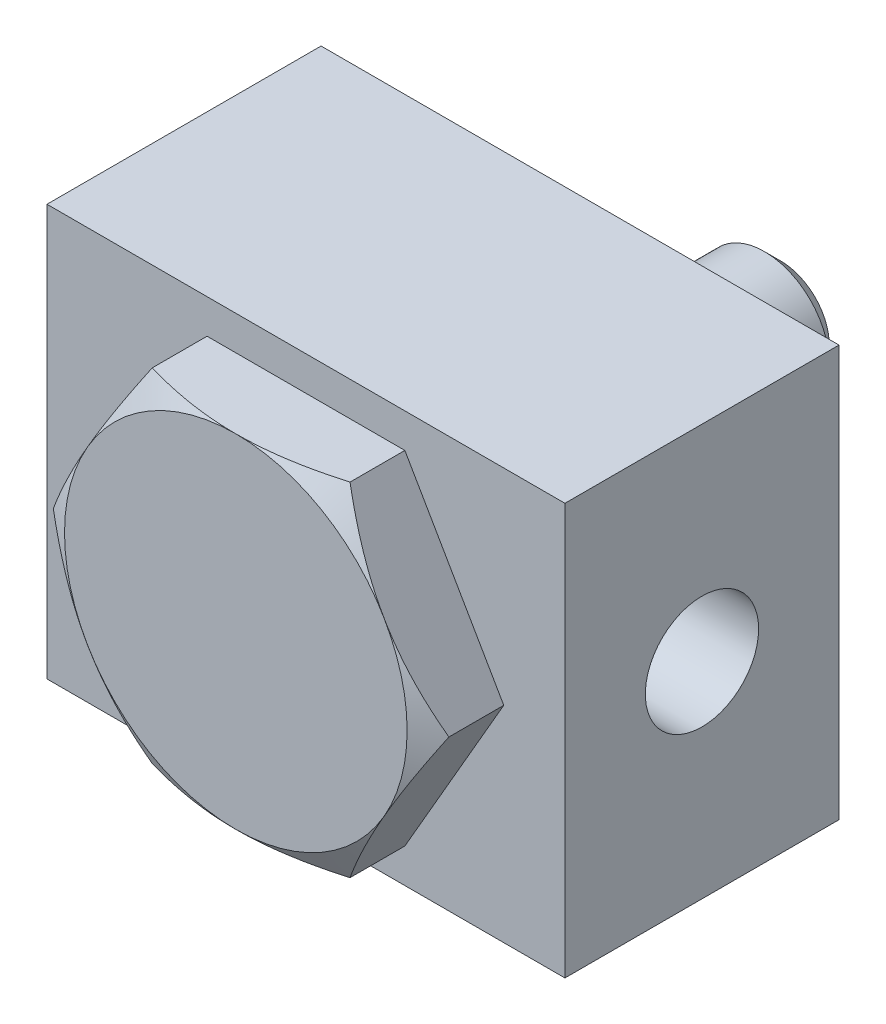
ISO-10303-21;
HEADER;
FILE_DESCRIPTION(('STEP AP214'),'2;1');
FILE_NAME('part.step','',(''),(''),'','','');
FILE_SCHEMA(('AUTOMOTIVE_DESIGN { 1 0 10303 214 1 1 1 1 }'));
ENDSEC;
DATA;
#1=APPLICATION_CONTEXT('core data for automotive mechanical design processes');
#2=APPLICATION_PROTOCOL_DEFINITION('international standard','automotive_design',2000,#1);
#3=PRODUCT_CONTEXT('',#1,'mechanical');
#4=PRODUCT('Part','Part','',(#3));
#5=PRODUCT_RELATED_PRODUCT_CATEGORY('part','',(#4));
#6=PRODUCT_DEFINITION_FORMATION('','',#4);
#7=PRODUCT_DEFINITION_CONTEXT('part definition',#1,'design');
#8=PRODUCT_DEFINITION('design','',#6,#7);
#9=PRODUCT_DEFINITION_SHAPE('','',#8);
#10=(LENGTH_UNIT() NAMED_UNIT(*) SI_UNIT(.MILLI.,.METRE.));
#11=(NAMED_UNIT(*) PLANE_ANGLE_UNIT() SI_UNIT($,.RADIAN.));
#12=(NAMED_UNIT(*) SI_UNIT($,.STERADIAN.) SOLID_ANGLE_UNIT());
#13=UNCERTAINTY_MEASURE_WITH_UNIT(LENGTH_MEASURE(1.E-05),#10,'distance_accuracy_value','');
#14=(GEOMETRIC_REPRESENTATION_CONTEXT(3) GLOBAL_UNCERTAINTY_ASSIGNED_CONTEXT((#13)) GLOBAL_UNIT_ASSIGNED_CONTEXT((#10,
#11,#12)) REPRESENTATION_CONTEXT('',''));
#15=CARTESIAN_POINT('',(0.,0.,0.));
#16=DIRECTION('',(0.,0.,1.));
#17=DIRECTION('',(1.,0.,0.));
#18=AXIS2_PLACEMENT_3D('',#15,#16,#17);
#19=CARTESIAN_POINT('',(-18.3308710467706,31.75,70.3));
#20=DIRECTION('',(0.866025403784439,-0.5,0.));
#21=DIRECTION('',(0.5,0.866025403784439,0.));
#22=AXIS2_PLACEMENT_3D('',#19,#20,#21);
#23=PLANE('',#22);
#24=CARTESIAN_POINT('',(-18.3307555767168,31.7502,62.4641377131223));
#25=CARTESIAN_POINT('',(-18.7336598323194,31.0523493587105,62.6967369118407));
#26=CARTESIAN_POINT('',(-19.13813562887,30.3517767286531,62.9187809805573));
#27=CARTESIAN_POINT('',(-19.9503306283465,28.9450137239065,63.3388249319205));
#28=CARTESIAN_POINT('',(-20.358050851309,28.238821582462,63.5368169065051));
#29=CARTESIAN_POINT('',(-21.1775313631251,26.8194397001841,63.906099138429));
#30=CARTESIAN_POINT('',(-21.5892988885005,26.1062374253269,64.0773256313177));
#31=CARTESIAN_POINT('',(-22.4156776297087,24.6749074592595,64.3893882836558));
#32=CARTESIAN_POINT('',(-22.8302885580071,23.9567802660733,64.5302274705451));
#33=CARTESIAN_POINT('',(-23.6517563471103,22.5339563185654,64.7755371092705));
#34=CARTESIAN_POINT('',(-24.0585522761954,21.8293651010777,64.8808188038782));
#35=CARTESIAN_POINT('',(-24.8740080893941,20.4169542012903,65.0573518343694));
#36=CARTESIAN_POINT('',(-25.2826680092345,19.7091344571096,65.1286025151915));
#37=CARTESIAN_POINT('',(-26.100674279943,18.2923060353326,65.2352744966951));
#38=CARTESIAN_POINT('',(-26.5100192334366,17.5832997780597,65.2707383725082));
#39=CARTESIAN_POINT('',(-27.3290869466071,16.1646328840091,65.3050740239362));
#40=CARTESIAN_POINT('',(-27.7388096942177,15.4549722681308,65.3039469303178));
#41=CARTESIAN_POINT('',(-28.5047899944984,14.1282554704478,65.2676569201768));
#42=CARTESIAN_POINT('',(-28.8611021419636,13.5111047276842,65.2369192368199));
#43=CARTESIAN_POINT('',(-29.5728766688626,12.2782750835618,65.1483534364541));
#44=CARTESIAN_POINT('',(-29.9283390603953,11.6625961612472,65.0905257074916));
#45=CARTESIAN_POINT('',(-30.6382785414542,10.4329449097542,64.9487854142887));
#46=CARTESIAN_POINT('',(-30.9927544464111,9.81897463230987,64.8648492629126));
#47=CARTESIAN_POINT('',(-31.7000213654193,8.59395239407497,64.6723649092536));
#48=CARTESIAN_POINT('',(-32.0528123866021,7.98290042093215,64.5638168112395));
#49=CARTESIAN_POINT('',(-32.7641994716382,6.75074184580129,64.3211744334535));
#50=CARTESIAN_POINT('',(-33.1227517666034,6.12971105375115,64.186569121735));
#51=CARTESIAN_POINT('',(-33.8376618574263,4.89145045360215,63.895403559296));
#52=CARTESIAN_POINT('',(-34.1940193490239,4.27422117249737,63.7388403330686));
#53=CARTESIAN_POINT('',(-34.9037042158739,3.04501092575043,63.4061282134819));
#54=CARTESIAN_POINT('',(-35.2570361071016,2.43302213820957,63.2300176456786));
#55=CARTESIAN_POINT('',(-35.9612560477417,1.21327742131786,62.8599677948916));
#56=CARTESIAN_POINT('',(-36.3121447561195,0.605520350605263,62.6660335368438));
#57=CARTESIAN_POINT('',(-36.6618575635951,-0.000200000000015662,62.4641377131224));
#58=B_SPLINE_CURVE_WITH_KNOTS('',3,(#24,#25,#26,#27,#28,#29,#30,#31,#32,#33,#34,#35,#36,#37,#38,
#39,#40,#41,#42,#43,#44,#45,#46,#47,#48,#49,#50,#51,#52,#53,#54,#55,#56,#57),.UNSPECIFIED.,.F.,
.F.,(4,2,2,2,2,2,2,2,2,2,2,2,2,2,2,2,4),(0.,2.51618738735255,5.03319984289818,7.55612017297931,
10.078789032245,12.5392457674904,14.999749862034,17.4573232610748,19.9148207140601,
22.0541658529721,24.1934803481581,26.3347332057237,28.4759769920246,30.6644883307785,
32.8532965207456,35.0378865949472,37.2218626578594),.UNSPECIFIED.);
#59=CARTESIAN_POINT('',(-18.3308710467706,31.75,62.464204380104));
#60=VERTEX_POINT('',#59);
#61=CARTESIAN_POINT('',(-27.496306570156,15.875,65.3));
#62=VERTEX_POINT('',#61);
#63=EDGE_CURVE('E109',#60,#62,#58,.T.);
#64=ORIENTED_EDGE('',*,*,#63,.F.);
#65=DIRECTION('',(0.,0.,-1.));
#66=VECTOR('',#65,1.);
#67=CARTESIAN_POINT('',(-18.3308710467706,31.75,70.3));
#68=LINE('',#67,#66);
#69=CARTESIAN_POINT('',(-18.3308710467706,31.75,52.3));
#70=VERTEX_POINT('',#69);
#71=EDGE_CURVE('E300',#60,#70,#68,.T.);
#72=ORIENTED_EDGE('',*,*,#71,.T.);
#73=DIRECTION('',(-0.5,-0.866025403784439,0.));
#74=VECTOR('',#73,1.);
#75=CARTESIAN_POINT('',(-18.3308710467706,31.75,52.3));
#76=LINE('',#75,#74);
#77=CARTESIAN_POINT('',(-36.6617420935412,0.,52.3));
#78=VERTEX_POINT('',#77);
#79=EDGE_CURVE('E118',#70,#78,#76,.T.);
#80=ORIENTED_EDGE('',*,*,#79,.T.);
#81=DIRECTION('',(0.,0.,-1.));
#82=VECTOR('',#81,1.);
#83=CARTESIAN_POINT('',(-36.6617420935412,0.,70.3));
#84=LINE('',#83,#82);
#85=CARTESIAN_POINT('',(-36.6617420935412,0.,62.464204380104));
#86=VERTEX_POINT('',#85);
#87=EDGE_CURVE('E135',#86,#78,#84,.T.);
#88=ORIENTED_EDGE('',*,*,#87,.F.);
#89=EDGE_CURVE('E119',#62,#86,#58,.T.);
#90=ORIENTED_EDGE('',*,*,#89,.F.);
#91=EDGE_LOOP('',(#64,#72,#80,#88,#90));
#92=FACE_BOUND('',#91,.T.);
#93=ADVANCED_FACE('F16',(#92),#23,.F.);
#94=CARTESIAN_POINT('',(-36.6617420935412,0.,70.3));
#95=DIRECTION('',(0.866025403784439,0.5,0.));
#96=DIRECTION('',(-0.5,0.866025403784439,0.));
#97=AXIS2_PLACEMENT_3D('',#94,#95,#96);
#98=PLANE('',#97);
#99=CARTESIAN_POINT('',(-36.6618575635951,0.000199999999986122,62.4641377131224));
#100=CARTESIAN_POINT('',(-36.2589533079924,-0.69765064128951,62.6967369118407));
#101=CARTESIAN_POINT('',(-35.8544775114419,-1.39822327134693,62.9187809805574));
#102=CARTESIAN_POINT('',(-35.0422825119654,-2.80498627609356,63.3388249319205));
#103=CARTESIAN_POINT('',(-34.6345622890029,-3.51117841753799,63.5368169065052));
#104=CARTESIAN_POINT('',(-33.8150817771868,-4.93056029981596,63.906099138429));
#105=CARTESIAN_POINT('',(-33.4033142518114,-5.64376257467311,64.0773256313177));
#106=CARTESIAN_POINT('',(-32.5769355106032,-7.07509254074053,64.3893882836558));
#107=CARTESIAN_POINT('',(-32.1623245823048,-7.79321973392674,64.5302274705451));
#108=CARTESIAN_POINT('',(-31.3408567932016,-9.21604368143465,64.7755371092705));
#109=CARTESIAN_POINT('',(-30.9340608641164,-9.92063489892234,64.8808188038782));
#110=CARTESIAN_POINT('',(-30.1186050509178,-11.3330457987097,65.0573518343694));
#111=CARTESIAN_POINT('',(-29.7099451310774,-12.0408655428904,65.1286025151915));
#112=CARTESIAN_POINT('',(-28.8919388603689,-13.4576939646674,65.2352744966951));
#113=CARTESIAN_POINT('',(-28.4825939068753,-14.1667002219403,65.2707383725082));
#114=CARTESIAN_POINT('',(-27.6635261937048,-15.5853671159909,65.3050740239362));
#115=CARTESIAN_POINT('',(-27.2538034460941,-16.2950277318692,65.3039469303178));
#116=CARTESIAN_POINT('',(-26.4878231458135,-17.6217445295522,65.2676569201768));
#117=CARTESIAN_POINT('',(-26.1315109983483,-18.2388952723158,65.2369192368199));
#118=CARTESIAN_POINT('',(-25.4197364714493,-19.4717249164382,65.1483534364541));
#119=CARTESIAN_POINT('',(-25.0642740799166,-20.0874038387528,65.0905257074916));
#120=CARTESIAN_POINT('',(-24.3543345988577,-21.3170550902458,64.9487854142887));
#121=CARTESIAN_POINT('',(-23.9998586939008,-21.9310253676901,64.8648492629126));
#122=CARTESIAN_POINT('',(-23.2925917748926,-23.156047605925,64.6723649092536));
#123=CARTESIAN_POINT('',(-22.9398007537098,-23.7670995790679,64.5638168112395));
#124=CARTESIAN_POINT('',(-22.2284136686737,-24.9992581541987,64.3211744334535));
#125=CARTESIAN_POINT('',(-21.8698613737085,-25.6202889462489,64.1865691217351));
#126=CARTESIAN_POINT('',(-21.1549512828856,-26.8585495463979,63.895403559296));
#127=CARTESIAN_POINT('',(-20.798593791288,-27.4757788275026,63.7388403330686));
#128=CARTESIAN_POINT('',(-20.088908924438,-28.7049890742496,63.4061282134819));
#129=CARTESIAN_POINT('',(-19.7355770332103,-29.3169778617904,63.2300176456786));
#130=CARTESIAN_POINT('',(-19.0313570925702,-30.5367225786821,62.8599677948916));
#131=CARTESIAN_POINT('',(-18.6804683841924,-31.1444796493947,62.6660335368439));
#132=CARTESIAN_POINT('',(-18.3307555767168,-31.7502,62.4641377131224));
#133=B_SPLINE_CURVE_WITH_KNOTS('',3,(#99,#100,#101,#102,#103,#104,#105,#106,#107,#108,#109,#110,
#111,#112,#113,#114,#115,#116,#117,#118,#119,#120,#121,#122,#123,#124,#125,#126,#127,#128,#129,
#130,#131,#132),.UNSPECIFIED.,.F.,.F.,(4,2,2,2,2,2,2,2,2,2,2,2,2,2,2,2,4),(0.,2.51618738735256,
5.03319984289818,7.5561201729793,10.078789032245,12.5392457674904,14.999749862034,
17.4573232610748,19.9148207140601,22.054165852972,24.193480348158,26.3347332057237,
28.4759769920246,30.6644883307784,32.8532965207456,35.0378865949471,37.2218626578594),.UNSPECIFIED.);
#134=CARTESIAN_POINT('',(-27.496306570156,-15.875,65.3));
#135=VERTEX_POINT('',#134);
#136=EDGE_CURVE('E125',#86,#135,#133,.T.);
#137=ORIENTED_EDGE('',*,*,#136,.F.);
#138=ORIENTED_EDGE('',*,*,#87,.T.);
#139=DIRECTION('',(0.5,-0.866025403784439,0.));
#140=VECTOR('',#139,1.);
#141=CARTESIAN_POINT('',(-36.6617420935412,0.,52.3));
#142=LINE('',#141,#140);
#143=CARTESIAN_POINT('',(-18.3308710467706,-31.75,52.3));
#144=VERTEX_POINT('',#143);
#145=EDGE_CURVE('E311',#78,#144,#142,.T.);
#146=ORIENTED_EDGE('',*,*,#145,.T.);
#147=DIRECTION('',(0.,0.,-1.));
#148=VECTOR('',#147,1.);
#149=CARTESIAN_POINT('',(-18.3308710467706,-31.75,70.3));
#150=LINE('',#149,#148);
#151=CARTESIAN_POINT('',(-18.3308710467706,-31.75,62.464204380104));
#152=VERTEX_POINT('',#151);
#153=EDGE_CURVE('E212',#152,#144,#150,.T.);
#154=ORIENTED_EDGE('',*,*,#153,.F.);
#155=EDGE_CURVE('E136',#135,#152,#133,.T.);
#156=ORIENTED_EDGE('',*,*,#155,.F.);
#157=EDGE_LOOP('',(#137,#138,#146,#154,#156));
#158=FACE_BOUND('',#157,.T.);
#159=ADVANCED_FACE('F198',(#158),#98,.F.);
#160=CARTESIAN_POINT('',(-18.3308710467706,-31.75,70.3));
#161=DIRECTION('',(0.,1.,0.));
#162=DIRECTION('',(-1.,0.,0.));
#163=AXIS2_PLACEMENT_3D('',#160,#161,#162);
#164=PLANE('',#163);
#165=CARTESIAN_POINT('',(-49.0609987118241,-31.75,49.8914574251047));
#166=CARTESIAN_POINT('',(-48.3684107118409,-31.75,50.2271485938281));
#167=CARTESIAN_POINT('',(-47.6750046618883,-31.75,50.5611570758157));
#168=CARTESIAN_POINT('',(-46.2863868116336,-31.75,51.2254164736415));
#169=CARTESIAN_POINT('',(-45.5911749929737,-31.75,51.5556673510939));
#170=CARTESIAN_POINT('',(-44.1986810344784,-31.75,52.2120638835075));
#171=CARTESIAN_POINT('',(-43.5013985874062,-31.75,52.5382088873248));
#172=CARTESIAN_POINT('',(-42.1046897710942,-31.75,53.1858689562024));
#173=CARTESIAN_POINT('',(-41.4052634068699,-31.75,53.5073840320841));
#174=CARTESIAN_POINT('',(-39.29574648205,-31.75,54.4677329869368));
#175=CARTESIAN_POINT('',(-37.8820802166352,-31.75,55.0987453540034));
#176=CARTESIAN_POINT('',(-35.0434372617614,-31.75,56.3347449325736));
#177=CARTESIAN_POINT('',(-33.6184611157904,-31.75,56.9397333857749));
#178=CARTESIAN_POINT('',(-31.4481556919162,-31.75,57.8317691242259));
#179=CARTESIAN_POINT('',(-30.7078021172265,-31.75,58.1309335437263));
#180=CARTESIAN_POINT('',(-29.2231292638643,-31.75,58.7192803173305));
#181=CARTESIAN_POINT('',(-28.4788099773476,-31.75,59.008462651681));
#182=CARTESIAN_POINT('',(-26.9857641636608,-31.75,59.5755330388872));
#183=CARTESIAN_POINT('',(-26.2370370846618,-31.75,59.8534196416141));
#184=CARTESIAN_POINT('',(-24.7349201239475,-31.75,60.3963012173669));
#185=CARTESIAN_POINT('',(-23.9815302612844,-31.75,60.6612962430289));
#186=CARTESIAN_POINT('',(-22.4712971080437,-31.75,61.1760941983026));
#187=CARTESIAN_POINT('',(-21.7144642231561,-31.75,61.4259275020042));
#188=CARTESIAN_POINT('',(-20.1955328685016,-31.75,61.90898962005));
#189=CARTESIAN_POINT('',(-19.4334343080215,-31.75,62.1422181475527));
#190=CARTESIAN_POINT('',(-17.1392161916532,-31.75,62.8136001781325));
#191=CARTESIAN_POINT('',(-15.5985913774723,-31.75,63.2236522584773));
#192=CARTESIAN_POINT('',(-13.2752970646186,-31.75,63.7663407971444));
#193=CARTESIAN_POINT('',(-12.5009089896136,-31.75,63.9348146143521));
#194=CARTESIAN_POINT('',(-10.9468685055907,-31.75,64.2456093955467));
#195=CARTESIAN_POINT('',(-10.1672162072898,-31.75,64.3879309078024));
#196=CARTESIAN_POINT('',(-8.60321979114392,-31.75,64.6438959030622));
#197=CARTESIAN_POINT('',(-7.81887581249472,-31.75,64.7575402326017));
#198=CARTESIAN_POINT('',(-6.24629654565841,-31.75,64.953884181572));
#199=CARTESIAN_POINT('',(-5.4580612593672,-31.75,65.036583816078));
#200=CARTESIAN_POINT('',(-3.88905799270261,-31.75,65.1683616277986));
#201=CARTESIAN_POINT('',(-3.10832565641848,-31.75,65.2178617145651));
#202=CARTESIAN_POINT('',(-1.54546751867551,-31.75,65.2838124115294));
#203=CARTESIAN_POINT('',(-0.763341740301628,-31.75,65.3002635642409));
#204=CARTESIAN_POINT('',(0.80090033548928,-31.75,65.2997300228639));
#205=CARTESIAN_POINT('',(1.58301663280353,-31.75,65.2827450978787));
#206=CARTESIAN_POINT('',(3.14586968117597,-31.75,65.215734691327));
#207=CARTESIAN_POINT('',(3.92660636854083,-31.75,65.1657077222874));
#208=CARTESIAN_POINT('',(5.25717405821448,-31.75,65.0530813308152));
#209=CARTESIAN_POINT('',(5.80769556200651,-31.75,64.9984491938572));
#210=CARTESIAN_POINT('',(6.90700558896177,-31.75,64.8738397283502));
#211=CARTESIAN_POINT('',(7.45579406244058,-31.75,64.8038619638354));
#212=CARTESIAN_POINT('',(9.09913998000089,-31.75,64.5719348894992));
#213=CARTESIAN_POINT('',(10.1906479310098,-31.75,64.3879944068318));
#214=CARTESIAN_POINT('',(12.3643105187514,-31.75,63.96798055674));
#215=CARTESIAN_POINT('',(13.4464570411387,-31.75,63.7318659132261));
#216=CARTESIAN_POINT('',(15.5998610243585,-31.75,63.2147070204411));
#217=CARTESIAN_POINT('',(16.6711186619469,-31.75,62.9336635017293));
#218=CARTESIAN_POINT('',(18.8260878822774,-31.75,62.3268831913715));
#219=CARTESIAN_POINT('',(19.9095606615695,-31.75,62.0003045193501));
#220=CARTESIAN_POINT('',(22.065830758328,-31.75,61.3138040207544));
#221=CARTESIAN_POINT('',(23.1386280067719,-31.75,60.9538819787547));
#222=CARTESIAN_POINT('',(25.2740913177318,-31.75,60.2063728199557));
#223=CARTESIAN_POINT('',(26.3367607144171,-31.75,59.8187951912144));
#224=CARTESIAN_POINT('',(27.9241682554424,-31.75,59.22007093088));
#225=CARTESIAN_POINT('',(28.452204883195,-31.75,59.0176031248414));
#226=CARTESIAN_POINT('',(29.5062159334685,-31.75,58.6073631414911));
#227=CARTESIAN_POINT('',(30.0321903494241,-31.75,58.399590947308));
#228=CARTESIAN_POINT('',(31.941261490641,-31.75,57.6352911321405));
#229=CARTESIAN_POINT('',(33.3186160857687,-31.75,57.064387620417));
#230=CARTESIAN_POINT('',(36.0620094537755,-31.75,55.8959695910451));
#231=CARTESIAN_POINT('',(37.4280475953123,-31.75,55.2984536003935));
#232=CARTESIAN_POINT('',(40.1508563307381,-31.75,54.081983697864));
#233=CARTESIAN_POINT('',(41.5076249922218,-31.75,53.4630254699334));
#234=CARTESIAN_POINT('',(44.2131157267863,-31.75,52.2078748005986));
#235=CARTESIAN_POINT('',(45.561837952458,-31.75,51.5716826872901));
#236=CARTESIAN_POINT('',(48.2539031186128,-31.75,50.2845467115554));
#237=CARTESIAN_POINT('',(49.5972391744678,-31.75,49.6335884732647));
#238=CARTESIAN_POINT('',(52.2781978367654,-31.75,48.3200139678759));
#239=CARTESIAN_POINT('',(53.6158204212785,-31.75,47.6573976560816));
#240=CARTESIAN_POINT('',(56.2860541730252,-31.75,46.3225321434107));
#241=CARTESIAN_POINT('',(57.6186658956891,-31.75,45.6502840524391));
#242=CARTESIAN_POINT('',(60.2797370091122,-31.75,44.2976313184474));
#243=CARTESIAN_POINT('',(61.6081964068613,-31.75,43.6172266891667));
#244=CARTESIAN_POINT('',(64.1545838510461,-31.75,42.3046429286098));
#245=CARTESIAN_POINT('',(65.3727877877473,-31.75,41.6729986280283));
#246=CARTESIAN_POINT('',(67.8065601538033,-31.75,40.4046512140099));
#247=CARTESIAN_POINT('',(69.0221285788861,-31.75,39.7679480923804));
#248=CARTESIAN_POINT('',(72.6654502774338,-31.75,37.8512322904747));
#249=CARTESIAN_POINT('',(75.0897489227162,-31.75,36.5646499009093));
#250=CARTESIAN_POINT('',(78.7179557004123,-31.75,34.6262068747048));
#251=CARTESIAN_POINT('',(79.924569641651,-31.75,33.979396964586));
#252=CARTESIAN_POINT('',(82.3361973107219,-31.75,32.6827982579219));
#253=CARTESIAN_POINT('',(83.5412110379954,-31.75,32.0330094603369));
#254=CARTESIAN_POINT('',(85.9497498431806,-31.75,30.7308286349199));
#255=CARTESIAN_POINT('',(87.153274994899,-31.75,30.0784367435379));
#256=CARTESIAN_POINT('',(89.5590411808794,-31.75,28.7712938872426));
#257=CARTESIAN_POINT('',(90.7612822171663,-31.75,28.1165429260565));
#258=CARTESIAN_POINT('',(91.9629541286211,-31.75,27.4607501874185));
#259=B_SPLINE_CURVE_WITH_KNOTS('',3,(#165,#166,#167,#168,#169,#170,#171,#172,#173,#174,#175,
#176,#177,#178,#179,#180,#181,#182,#183,#184,#185,#186,#187,#188,#189,#190,#191,#192,#193,#194,
#195,#196,#197,#198,#199,#200,#201,#202,#203,#204,#205,#206,#207,#208,#209,#210,#211,#212,#213,
#214,#215,#216,#217,#218,#219,#220,#221,#222,#223,#224,#225,#226,#227,#228,#229,#230,#231,#232,
#233,#234,#235,#236,#237,#238,#239,#240,#241,#242,#243,#244,#245,#246,#247,#248,#249,#250,#251,
#252,#253,#254,#255,#256,#257,#258),.UNSPECIFIED.,.F.,.F.,(4,2,2,2,2,2,2,2,2,2,2,2,2,2,2,2,2,2,
2,2,2,2,2,2,2,2,2,2,2,2,2,2,2,2,2,2,2,2,2,2,2,2,2,2,2,2,4),(0.,2.30896175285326,
4.61794707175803,6.92729406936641,9.23663566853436,13.8807459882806,18.5246344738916,
20.9201141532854,23.3155985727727,25.7113895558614,28.1071707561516,30.4979821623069,
32.8888348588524,37.668691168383,40.0458440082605,42.4229470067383,44.7999798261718,
47.1770114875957,49.5232318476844,51.8694136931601,54.2156117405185,56.5619154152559,
58.2213801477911,59.8808920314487,63.2000059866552,66.5217552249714,69.8434504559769,
73.2376744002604,76.6319202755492,80.025007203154,81.721552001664,83.4181021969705,
87.890651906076,92.3634494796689,96.8371526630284,101.310770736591,105.788948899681,
110.267144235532,114.744827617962,119.222503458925,123.339158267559,127.455819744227,
135.689382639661,139.796511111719,143.903641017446,148.01055839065,152.117469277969),.UNSPECIFIED.);
#260=CARTESIAN_POINT('',(0.,-31.75,65.3));
#261=VERTEX_POINT('',#260);
#262=EDGE_CURVE('E192',#152,#261,#259,.T.);
#263=ORIENTED_EDGE('',*,*,#262,.F.);
#264=ORIENTED_EDGE('',*,*,#153,.T.);
#265=DIRECTION('',(1.,0.,0.));
#266=VECTOR('',#265,1.);
#267=CARTESIAN_POINT('',(-18.3308710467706,-31.75,52.3));
#268=LINE('',#267,#266);
#269=CARTESIAN_POINT('',(18.3308710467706,-31.75,52.3));
#270=VERTEX_POINT('',#269);
#271=EDGE_CURVE('E229',#144,#270,#268,.T.);
#272=ORIENTED_EDGE('',*,*,#271,.T.);
#273=DIRECTION('',(0.,0.,-1.));
#274=VECTOR('',#273,1.);
#275=CARTESIAN_POINT('',(18.3308710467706,-31.75,70.3));
#276=LINE('',#275,#274);
#277=CARTESIAN_POINT('',(18.3308710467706,-31.75,62.464204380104));
#278=VERTEX_POINT('',#277);
#279=EDGE_CURVE('E227',#278,#270,#276,.T.);
#280=ORIENTED_EDGE('',*,*,#279,.F.);
#281=EDGE_CURVE('E186',#261,#278,#259,.T.);
#282=ORIENTED_EDGE('',*,*,#281,.F.);
#283=EDGE_LOOP('',(#263,#264,#272,#280,#282));
#284=FACE_BOUND('',#283,.T.);
#285=ADVANCED_FACE('F194',(#284),#164,.F.);
#286=CARTESIAN_POINT('',(18.3308710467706,-31.75,70.3));
#287=DIRECTION('',(-0.866025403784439,0.5,0.));
#288=DIRECTION('',(-0.5,-0.866025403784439,0.));
#289=AXIS2_PLACEMENT_3D('',#286,#287,#288);
#290=PLANE('',#289);
#291=CARTESIAN_POINT('',(18.3307555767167,-31.7502,62.4641377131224));
#292=CARTESIAN_POINT('',(18.7336598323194,-31.0523493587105,62.6967369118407));
#293=CARTESIAN_POINT('',(19.1381356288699,-30.3517767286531,62.9187809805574));
#294=CARTESIAN_POINT('',(19.9503306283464,-28.9450137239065,63.3388249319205));
#295=CARTESIAN_POINT('',(20.358050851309,-28.238821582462,63.5368169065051));
#296=CARTESIAN_POINT('',(21.177531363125,-26.8194397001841,63.9060991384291));
#297=CARTESIAN_POINT('',(21.5892988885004,-26.1062374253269,64.0773256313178));
#298=CARTESIAN_POINT('',(22.4156776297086,-24.6749074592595,64.3893882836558));
#299=CARTESIAN_POINT('',(22.8302885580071,-23.9567802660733,64.5302274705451));
#300=CARTESIAN_POINT('',(23.6517563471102,-22.5339563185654,64.7755371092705));
#301=CARTESIAN_POINT('',(24.0585522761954,-21.8293651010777,64.8808188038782));
#302=CARTESIAN_POINT('',(24.874008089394,-20.4169542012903,65.0573518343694));
#303=CARTESIAN_POINT('',(25.2826680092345,-19.7091344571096,65.1286025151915));
#304=CARTESIAN_POINT('',(26.1006742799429,-18.2923060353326,65.2352744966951));
#305=CARTESIAN_POINT('',(26.5100192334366,-17.5832997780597,65.2707383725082));
#306=CARTESIAN_POINT('',(27.3290869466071,-16.1646328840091,65.3050740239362));
#307=CARTESIAN_POINT('',(27.7388096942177,-15.4549722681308,65.3039469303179));
#308=CARTESIAN_POINT('',(28.5047899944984,-14.1282554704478,65.2676569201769));
#309=CARTESIAN_POINT('',(28.8611021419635,-13.5111047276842,65.2369192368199));
#310=CARTESIAN_POINT('',(29.5728766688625,-12.2782750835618,65.1483534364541));
#311=CARTESIAN_POINT('',(29.9283390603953,-11.6625961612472,65.0905257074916));
#312=CARTESIAN_POINT('',(30.6382785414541,-10.4329449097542,64.9487854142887));
#313=CARTESIAN_POINT('',(30.992754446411,-9.81897463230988,64.8648492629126));
#314=CARTESIAN_POINT('',(31.7000213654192,-8.59395239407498,64.6723649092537));
#315=CARTESIAN_POINT('',(32.0528123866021,-7.98290042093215,64.5638168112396));
#316=CARTESIAN_POINT('',(32.7641994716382,-6.75074184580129,64.3211744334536));
#317=CARTESIAN_POINT('',(33.1227517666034,-6.12971105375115,64.1865691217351));
#318=CARTESIAN_POINT('',(33.8376618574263,-4.89145045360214,63.895403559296));
#319=CARTESIAN_POINT('',(34.1940193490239,-4.27422117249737,63.7388403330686));
#320=CARTESIAN_POINT('',(34.9037042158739,-3.04501092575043,63.406128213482));
#321=CARTESIAN_POINT('',(35.2570361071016,-2.43302213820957,63.2300176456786));
#322=CARTESIAN_POINT('',(35.9612560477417,-1.21327742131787,62.8599677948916));
#323=CARTESIAN_POINT('',(36.3121447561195,-0.605520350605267,62.6660335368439));
#324=CARTESIAN_POINT('',(36.661857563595,0.000200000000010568,62.4641377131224));
#325=B_SPLINE_CURVE_WITH_KNOTS('',3,(#291,#292,#293,#294,#295,#296,#297,#298,#299,#300,#301,
#302,#303,#304,#305,#306,#307,#308,#309,#310,#311,#312,#313,#314,#315,#316,#317,#318,#319,#320,
#321,#322,#323,#324),.UNSPECIFIED.,.F.,.F.,(4,2,2,2,2,2,2,2,2,2,2,2,2,2,2,2,4),(0.,
2.51618738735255,5.03319984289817,7.5561201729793,10.078789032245,12.5392457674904,
14.999749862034,17.4573232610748,19.9148207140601,22.054165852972,24.193480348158,
26.3347332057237,28.4759769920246,30.6644883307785,32.8532965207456,35.0378865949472,
37.2218626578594),.UNSPECIFIED.);
#326=CARTESIAN_POINT('',(27.496306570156,-15.875,65.3));
#327=VERTEX_POINT('',#326);
#328=EDGE_CURVE('E193',#278,#327,#325,.T.);
#329=ORIENTED_EDGE('',*,*,#328,.F.);
#330=ORIENTED_EDGE('',*,*,#279,.T.);
#331=DIRECTION('',(0.5,0.866025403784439,0.));
#332=VECTOR('',#331,1.);
#333=CARTESIAN_POINT('',(18.3308710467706,-31.75,52.3));
#334=LINE('',#333,#332);
#335=CARTESIAN_POINT('',(36.6617420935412,0.,52.3));
#336=VERTEX_POINT('',#335);
#337=EDGE_CURVE('E309',#270,#336,#334,.T.);
#338=ORIENTED_EDGE('',*,*,#337,.T.);
#339=DIRECTION('',(0.,0.,-1.));
#340=VECTOR('',#339,1.);
#341=CARTESIAN_POINT('',(36.6617420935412,0.,70.3));
#342=LINE('',#341,#340);
#343=CARTESIAN_POINT('',(36.6617420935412,0.,62.464204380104));
#344=VERTEX_POINT('',#343);
#345=EDGE_CURVE('E233',#344,#336,#342,.T.);
#346=ORIENTED_EDGE('',*,*,#345,.F.);
#347=EDGE_CURVE('E180',#327,#344,#325,.T.);
#348=ORIENTED_EDGE('',*,*,#347,.F.);
#349=EDGE_LOOP('',(#329,#330,#338,#346,#348));
#350=FACE_BOUND('',#349,.T.);
#351=ADVANCED_FACE('F197',(#350),#290,.F.);
#352=CARTESIAN_POINT('',(36.6617420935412,0.,70.3));
#353=DIRECTION('',(-0.866025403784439,-0.5,0.));
#354=DIRECTION('',(0.5,-0.866025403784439,0.));
#355=AXIS2_PLACEMENT_3D('',#352,#353,#354);
#356=PLANE('',#355);
#357=CARTESIAN_POINT('',(36.661857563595,-0.000199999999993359,62.4641377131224));
#358=CARTESIAN_POINT('',(36.2589533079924,0.697650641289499,62.6967369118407));
#359=CARTESIAN_POINT('',(35.8544775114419,1.39822327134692,62.9187809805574));
#360=CARTESIAN_POINT('',(35.0422825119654,2.80498627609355,63.3388249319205));
#361=CARTESIAN_POINT('',(34.6345622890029,3.51117841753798,63.5368169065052));
#362=CARTESIAN_POINT('',(33.8150817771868,4.93056029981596,63.9060991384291));
#363=CARTESIAN_POINT('',(33.4033142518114,5.6437625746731,64.0773256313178));
#364=CARTESIAN_POINT('',(32.5769355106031,7.07509254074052,64.3893882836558));
#365=CARTESIAN_POINT('',(32.1623245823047,7.79321973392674,64.5302274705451));
#366=CARTESIAN_POINT('',(31.3408567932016,9.21604368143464,64.7755371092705));
#367=CARTESIAN_POINT('',(30.9340608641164,9.92063489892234,64.8808188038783));
#368=CARTESIAN_POINT('',(30.1186050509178,11.3330457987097,65.0573518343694));
#369=CARTESIAN_POINT('',(29.7099451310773,12.0408655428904,65.1286025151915));
#370=CARTESIAN_POINT('',(28.8919388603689,13.4576939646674,65.2352744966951));
#371=CARTESIAN_POINT('',(28.4825939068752,14.1667002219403,65.2707383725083));
#372=CARTESIAN_POINT('',(27.6635261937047,15.5853671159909,65.3050740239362));
#373=CARTESIAN_POINT('',(27.2538034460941,16.2950277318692,65.3039469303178));
#374=CARTESIAN_POINT('',(26.4878231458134,17.6217445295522,65.2676569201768));
#375=CARTESIAN_POINT('',(26.1315109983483,18.2388952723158,65.2369192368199));
#376=CARTESIAN_POINT('',(25.4197364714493,19.4717249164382,65.1483534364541));
#377=CARTESIAN_POINT('',(25.0642740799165,20.0874038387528,65.0905257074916));
#378=CARTESIAN_POINT('',(24.3543345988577,21.3170550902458,64.9487854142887));
#379=CARTESIAN_POINT('',(23.9998586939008,21.9310253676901,64.8648492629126));
#380=CARTESIAN_POINT('',(23.2925917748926,23.156047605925,64.6723649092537));
#381=CARTESIAN_POINT('',(22.9398007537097,23.7670995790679,64.5638168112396));
#382=CARTESIAN_POINT('',(22.2284136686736,24.9992581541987,64.3211744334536));
#383=CARTESIAN_POINT('',(21.8698613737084,25.6202889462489,64.1865691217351));
#384=CARTESIAN_POINT('',(21.1549512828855,26.8585495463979,63.895403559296));
#385=CARTESIAN_POINT('',(20.7985937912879,27.4757788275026,63.7388403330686));
#386=CARTESIAN_POINT('',(20.088908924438,28.7049890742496,63.406128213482));
#387=CARTESIAN_POINT('',(19.7355770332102,29.3169778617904,63.2300176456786));
#388=CARTESIAN_POINT('',(19.0313570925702,30.5367225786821,62.8599677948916));
#389=CARTESIAN_POINT('',(18.6804683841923,31.1444796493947,62.6660335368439));
#390=CARTESIAN_POINT('',(18.3307555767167,31.7502,62.4641377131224));
#391=B_SPLINE_CURVE_WITH_KNOTS('',3,(#357,#358,#359,#360,#361,#362,#363,#364,#365,#366,#367,
#368,#369,#370,#371,#372,#373,#374,#375,#376,#377,#378,#379,#380,#381,#382,#383,#384,#385,#386,
#387,#388,#389,#390),.UNSPECIFIED.,.F.,.F.,(4,2,2,2,2,2,2,2,2,2,2,2,2,2,2,2,4),(0.,
2.51618738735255,5.03319984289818,7.5561201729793,10.078789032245,12.5392457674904,
14.999749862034,17.4573232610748,19.9148207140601,22.0541658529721,24.1934803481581,
26.3347332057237,28.4759769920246,30.6644883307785,32.8532965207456,35.0378865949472,
37.2218626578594),.UNSPECIFIED.);
#392=CARTESIAN_POINT('',(27.496306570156,15.875,65.3));
#393=VERTEX_POINT('',#392);
#394=EDGE_CURVE('E293',#344,#393,#391,.T.);
#395=ORIENTED_EDGE('',*,*,#394,.F.);
#396=ORIENTED_EDGE('',*,*,#345,.T.);
#397=DIRECTION('',(-0.5,0.866025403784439,0.));
#398=VECTOR('',#397,1.);
#399=CARTESIAN_POINT('',(36.6617420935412,0.,52.3));
#400=LINE('',#399,#398);
#401=CARTESIAN_POINT('',(18.3308710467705,31.75,52.3));
#402=VERTEX_POINT('',#401);
#403=EDGE_CURVE('E305',#336,#402,#400,.T.);
#404=ORIENTED_EDGE('',*,*,#403,.T.);
#405=DIRECTION('',(0.,0.,-1.));
#406=VECTOR('',#405,1.);
#407=CARTESIAN_POINT('',(18.3308710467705,31.75,70.3));
#408=LINE('',#407,#406);
#409=CARTESIAN_POINT('',(18.3308710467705,31.75,62.464204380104));
#410=VERTEX_POINT('',#409);
#411=EDGE_CURVE('E236',#410,#402,#408,.T.);
#412=ORIENTED_EDGE('',*,*,#411,.F.);
#413=EDGE_CURVE('E173',#393,#410,#391,.T.);
#414=ORIENTED_EDGE('',*,*,#413,.F.);
#415=EDGE_LOOP('',(#395,#396,#404,#412,#414));
#416=FACE_BOUND('',#415,.T.);
#417=ADVANCED_FACE('F292',(#416),#356,.F.);
#418=CARTESIAN_POINT('',(18.3308710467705,31.75,70.3));
#419=DIRECTION('',(0.,-1.,0.));
#420=DIRECTION('',(0.,0.,-1.));
#421=AXIS2_PLACEMENT_3D('',#418,#419,#420);
#422=PLANE('',#421);
#423=CARTESIAN_POINT('',(-49.0609987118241,31.75,49.8914574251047));
#424=CARTESIAN_POINT('',(-48.3684107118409,31.75,50.2271485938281));
#425=CARTESIAN_POINT('',(-47.6750046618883,31.75,50.5611570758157));
#426=CARTESIAN_POINT('',(-46.2863868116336,31.75,51.2254164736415));
#427=CARTESIAN_POINT('',(-45.5911749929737,31.75,51.5556673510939));
#428=CARTESIAN_POINT('',(-44.1986810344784,31.75,52.2120638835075));
#429=CARTESIAN_POINT('',(-43.5013985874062,31.75,52.5382088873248));
#430=CARTESIAN_POINT('',(-42.1046897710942,31.75,53.1858689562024));
#431=CARTESIAN_POINT('',(-41.4052634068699,31.75,53.5073840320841));
#432=CARTESIAN_POINT('',(-39.29574648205,31.75,54.4677329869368));
#433=CARTESIAN_POINT('',(-37.8820802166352,31.75,55.0987453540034));
#434=CARTESIAN_POINT('',(-35.0434372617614,31.75,56.3347449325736));
#435=CARTESIAN_POINT('',(-33.6184611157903,31.75,56.9397333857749));
#436=CARTESIAN_POINT('',(-31.4481556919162,31.75,57.8317691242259));
#437=CARTESIAN_POINT('',(-30.7078021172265,31.75,58.1309335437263));
#438=CARTESIAN_POINT('',(-29.2231292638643,31.75,58.7192803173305));
#439=CARTESIAN_POINT('',(-28.4788099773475,31.75,59.008462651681));
#440=CARTESIAN_POINT('',(-26.9857641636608,31.75,59.5755330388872));
#441=CARTESIAN_POINT('',(-26.2370370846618,31.75,59.8534196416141));
#442=CARTESIAN_POINT('',(-24.7349201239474,31.75,60.3963012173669));
#443=CARTESIAN_POINT('',(-23.9815302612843,31.75,60.6612962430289));
#444=CARTESIAN_POINT('',(-22.4712971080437,31.75,61.1760941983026));
#445=CARTESIAN_POINT('',(-21.7144642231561,31.75,61.4259275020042));
#446=CARTESIAN_POINT('',(-20.1955328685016,31.75,61.90898962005));
#447=CARTESIAN_POINT('',(-19.4334343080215,31.75,62.1422181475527));
#448=CARTESIAN_POINT('',(-17.1392161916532,31.75,62.8136001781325));
#449=CARTESIAN_POINT('',(-15.5985913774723,31.75,63.2236522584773));
#450=CARTESIAN_POINT('',(-13.2752970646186,31.75,63.7663407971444));
#451=CARTESIAN_POINT('',(-12.5009089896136,31.75,63.9348146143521));
#452=CARTESIAN_POINT('',(-10.9468685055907,31.75,64.2456093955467));
#453=CARTESIAN_POINT('',(-10.1672162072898,31.75,64.3879309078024));
#454=CARTESIAN_POINT('',(-8.60321979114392,31.75,64.6438959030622));
#455=CARTESIAN_POINT('',(-7.81887581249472,31.75,64.7575402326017));
#456=CARTESIAN_POINT('',(-6.24629654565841,31.75,64.953884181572));
#457=CARTESIAN_POINT('',(-5.4580612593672,31.75,65.036583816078));
#458=CARTESIAN_POINT('',(-3.88905799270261,31.75,65.1683616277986));
#459=CARTESIAN_POINT('',(-3.10832565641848,31.75,65.2178617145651));
#460=CARTESIAN_POINT('',(-1.54546751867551,31.75,65.2838124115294));
#461=CARTESIAN_POINT('',(-0.763341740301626,31.75,65.3002635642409));
#462=CARTESIAN_POINT('',(0.800900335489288,31.75,65.2997300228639));
#463=CARTESIAN_POINT('',(1.58301663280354,31.75,65.2827450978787));
#464=CARTESIAN_POINT('',(3.14586968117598,31.75,65.215734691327));
#465=CARTESIAN_POINT('',(3.92660636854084,31.75,65.1657077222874));
#466=CARTESIAN_POINT('',(5.25717405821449,31.75,65.0530813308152));
#467=CARTESIAN_POINT('',(5.80769556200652,31.75,64.9984491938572));
#468=CARTESIAN_POINT('',(6.90700558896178,31.75,64.8738397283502));
#469=CARTESIAN_POINT('',(7.45579406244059,31.75,64.8038619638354));
#470=CARTESIAN_POINT('',(9.09913998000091,31.75,64.5719348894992));
#471=CARTESIAN_POINT('',(10.1906479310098,31.75,64.3879944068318));
#472=CARTESIAN_POINT('',(12.3643105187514,31.75,63.96798055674));
#473=CARTESIAN_POINT('',(13.4464570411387,31.75,63.7318659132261));
#474=CARTESIAN_POINT('',(15.5998610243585,31.75,63.2147070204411));
#475=CARTESIAN_POINT('',(16.6711186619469,31.75,62.9336635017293));
#476=CARTESIAN_POINT('',(18.8260878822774,31.75,62.3268831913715));
#477=CARTESIAN_POINT('',(19.9095606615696,31.75,62.00030451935));
#478=CARTESIAN_POINT('',(22.065830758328,31.75,61.3138040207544));
#479=CARTESIAN_POINT('',(23.138628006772,31.75,60.9538819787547));
#480=CARTESIAN_POINT('',(25.2740913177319,31.75,60.2063728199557));
#481=CARTESIAN_POINT('',(26.3367607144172,31.75,59.8187951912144));
#482=CARTESIAN_POINT('',(27.9241682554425,31.75,59.22007093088));
#483=CARTESIAN_POINT('',(28.452204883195,31.75,59.0176031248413));
#484=CARTESIAN_POINT('',(29.5062159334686,31.75,58.6073631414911));
#485=CARTESIAN_POINT('',(30.0321903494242,31.75,58.399590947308));
#486=CARTESIAN_POINT('',(31.9412614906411,31.75,57.6352911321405));
#487=CARTESIAN_POINT('',(33.3186160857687,31.75,57.064387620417));
#488=CARTESIAN_POINT('',(36.0620094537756,31.75,55.8959695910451));
#489=CARTESIAN_POINT('',(37.4280475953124,31.75,55.2984536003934));
#490=CARTESIAN_POINT('',(40.1508563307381,31.75,54.081983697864));
#491=CARTESIAN_POINT('',(41.5076249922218,31.75,53.4630254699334));
#492=CARTESIAN_POINT('',(44.2131157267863,31.75,52.2078748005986));
#493=CARTESIAN_POINT('',(45.5618379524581,31.75,51.5716826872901));
#494=CARTESIAN_POINT('',(48.2539031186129,31.75,50.2845467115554));
#495=CARTESIAN_POINT('',(49.5972391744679,31.75,49.6335884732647));
#496=CARTESIAN_POINT('',(52.2781978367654,31.75,48.3200139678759));
#497=CARTESIAN_POINT('',(53.6158204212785,31.75,47.6573976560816));
#498=CARTESIAN_POINT('',(56.2860541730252,31.75,46.3225321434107));
#499=CARTESIAN_POINT('',(57.6186658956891,31.75,45.6502840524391));
#500=CARTESIAN_POINT('',(60.2797370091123,31.75,44.2976313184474));
#501=CARTESIAN_POINT('',(61.6081964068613,31.75,43.6172266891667));
#502=CARTESIAN_POINT('',(64.1545838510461,31.75,42.3046429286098));
#503=CARTESIAN_POINT('',(65.3727877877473,31.75,41.6729986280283));
#504=CARTESIAN_POINT('',(67.8065601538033,31.75,40.4046512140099));
#505=CARTESIAN_POINT('',(69.0221285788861,31.75,39.7679480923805));
#506=CARTESIAN_POINT('',(72.6654502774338,31.75,37.8512322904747));
#507=CARTESIAN_POINT('',(75.0897489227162,31.75,36.5646499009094));
#508=CARTESIAN_POINT('',(78.7179557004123,31.75,34.6262068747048));
#509=CARTESIAN_POINT('',(79.924569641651,31.75,33.979396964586));
#510=CARTESIAN_POINT('',(82.3361973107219,31.75,32.6827982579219));
#511=CARTESIAN_POINT('',(83.5412110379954,31.75,32.0330094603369));
#512=CARTESIAN_POINT('',(85.9497498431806,31.75,30.7308286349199));
#513=CARTESIAN_POINT('',(87.153274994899,31.75,30.0784367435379));
#514=CARTESIAN_POINT('',(89.5590411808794,31.75,28.7712938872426));
#515=CARTESIAN_POINT('',(90.7612822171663,31.75,28.1165429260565));
#516=CARTESIAN_POINT('',(91.9629541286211,31.75,27.4607501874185));
#517=B_SPLINE_CURVE_WITH_KNOTS('',3,(#423,#424,#425,#426,#427,#428,#429,#430,#431,#432,#433,
#434,#435,#436,#437,#438,#439,#440,#441,#442,#443,#444,#445,#446,#447,#448,#449,#450,#451,#452,
#453,#454,#455,#456,#457,#458,#459,#460,#461,#462,#463,#464,#465,#466,#467,#468,#469,#470,#471,
#472,#473,#474,#475,#476,#477,#478,#479,#480,#481,#482,#483,#484,#485,#486,#487,#488,#489,#490,
#491,#492,#493,#494,#495,#496,#497,#498,#499,#500,#501,#502,#503,#504,#505,#506,#507,#508,#509,
#510,#511,#512,#513,#514,#515,#516),.UNSPECIFIED.,.F.,.F.,(4,2,2,2,2,2,2,2,2,2,2,2,2,2,2,2,2,2,
2,2,2,2,2,2,2,2,2,2,2,2,2,2,2,2,2,2,2,2,2,2,2,2,2,2,2,2,4),(0.,2.30896175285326,
4.61794707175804,6.92729406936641,9.23663566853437,13.8807459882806,18.5246344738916,
20.9201141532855,23.3155985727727,25.7113895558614,28.1071707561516,30.4979821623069,
32.8888348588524,37.668691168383,40.0458440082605,42.4229470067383,44.7999798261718,
47.1770114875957,49.5232318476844,51.8694136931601,54.2156117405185,56.5619154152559,
58.2213801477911,59.8808920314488,63.2000059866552,66.5217552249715,69.8434504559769,
73.2376744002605,76.6319202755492,80.0250072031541,81.721552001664,83.4181021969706,
87.890651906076,92.363449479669,96.8371526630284,101.310770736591,105.788948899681,
110.267144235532,114.744827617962,119.222503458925,123.339158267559,127.455819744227,
135.689382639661,139.796511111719,143.903641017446,148.01055839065,152.117469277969),.UNSPECIFIED.);
#518=CARTESIAN_POINT('',(0.,31.75,65.3));
#519=VERTEX_POINT('',#518);
#520=EDGE_CURVE('E297',#410,#519,#517,.F.);
#521=ORIENTED_EDGE('',*,*,#520,.F.);
#522=ORIENTED_EDGE('',*,*,#411,.T.);
#523=DIRECTION('',(-1.,0.,0.));
#524=VECTOR('',#523,1.);
#525=CARTESIAN_POINT('',(18.3308710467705,31.75,52.3));
#526=LINE('',#525,#524);
#527=EDGE_CURVE('E302',#402,#70,#526,.T.);
#528=ORIENTED_EDGE('',*,*,#527,.T.);
#529=ORIENTED_EDGE('',*,*,#71,.F.);
#530=EDGE_CURVE('E114',#519,#60,#517,.F.);
#531=ORIENTED_EDGE('',*,*,#530,.F.);
#532=EDGE_LOOP('',(#521,#522,#528,#529,#531));
#533=FACE_BOUND('',#532,.T.);
#534=ADVANCED_FACE('F160',(#533),#422,.F.);
#535=CARTESIAN_POINT('',(0.,0.,-35.7));
#536=DIRECTION('',(0.,0.,-1.));
#537=DIRECTION('',(-1.,0.,0.));
#538=AXIS2_PLACEMENT_3D('',#535,#536,#537);
#539=PLANE('',#538);
#540=CARTESIAN_POINT('',(0.,0.,-35.7));
#541=DIRECTION('',(0.,0.,-1.));
#542=DIRECTION('',(-1.,0.,0.));
#543=AXIS2_PLACEMENT_3D('',#540,#541,#542);
#544=CIRCLE('',#543,9.);
#545=CARTESIAN_POINT('',(-9.,0.,-35.7));
#546=VERTEX_POINT('',#545);
#547=EDGE_CURVE('E258',#546,#546,#544,.T.);
#548=ORIENTED_EDGE('',*,*,#547,.T.);
#549=EDGE_LOOP('',(#548));
#550=FACE_BOUND('',#549,.T.);
#551=ADVANCED_FACE('F374',(#550),#539,.T.);
#552=CARTESIAN_POINT('',(0.,0.,-35.7));
#553=DIRECTION('',(0.,0.,1.));
#554=DIRECTION('',(1.,0.,0.));
#555=AXIS2_PLACEMENT_3D('',#552,#553,#554);
#556=CYLINDRICAL_SURFACE('',#555,12.);
#557=CARTESIAN_POINT('',(0.,0.,-32.7));
#558=DIRECTION('',(0.,0.,-1.));
#559=DIRECTION('',(-1.,0.,0.));
#560=AXIS2_PLACEMENT_3D('',#557,#558,#559);
#561=CIRCLE('',#560,12.);
#562=CARTESIAN_POINT('',(-12.,0.,-32.7));
#563=VERTEX_POINT('',#562);
#564=EDGE_CURVE('E283',#563,#563,#561,.F.);
#565=ORIENTED_EDGE('',*,*,#564,.T.);
#566=EDGE_LOOP('',(#565));
#567=FACE_BOUND('',#566,.T.);
#568=CARTESIAN_POINT('',(0.,0.,0.));
#569=DIRECTION('',(0.,0.,-1.));
#570=DIRECTION('',(-1.,0.,0.));
#571=AXIS2_PLACEMENT_3D('',#568,#569,#570);
#572=CIRCLE('',#571,12.);
#573=CARTESIAN_POINT('',(-12.,0.,0.));
#574=VERTEX_POINT('',#573);
#575=EDGE_CURVE('E241',#574,#574,#572,.T.);
#576=ORIENTED_EDGE('',*,*,#575,.T.);
#577=EDGE_LOOP('',(#576));
#578=FACE_BOUND('',#577,.T.);
#579=ADVANCED_FACE('F366',(#567,#578),#556,.T.);
#580=CARTESIAN_POINT('',(0.,0.,0.));
#581=DIRECTION('',(0.,0.,-1.));
#582=DIRECTION('',(-1.,0.,0.));
#583=AXIS2_PLACEMENT_3D('',#580,#581,#582);
#584=PLANE('',#583);
#585=CARTESIAN_POINT('',(0.,0.,0.));
#586=DIRECTION('',(0.,0.,-1.));
#587=DIRECTION('',(-1.,0.,0.));
#588=AXIS2_PLACEMENT_3D('',#585,#586,#587);
#589=CIRCLE('',#588,23.85);
#590=CARTESIAN_POINT('',(-23.85,0.,0.));
#591=VERTEX_POINT('',#590);
#592=EDGE_CURVE('E248',#591,#591,#589,.T.);
#593=ORIENTED_EDGE('',*,*,#592,.T.);
#594=EDGE_LOOP('',(#593));
#595=FACE_BOUND('',#594,.T.);
#596=ORIENTED_EDGE('',*,*,#575,.F.);
#597=EDGE_LOOP('',(#596));
#598=FACE_BOUND('',#597,.T.);
#599=ADVANCED_FACE('F348',(#595,#598),#584,.T.);
#600=CARTESIAN_POINT('',(0.,0.,0.));
#601=DIRECTION('',(0.,0.,1.));
#602=DIRECTION('',(1.,0.,0.));
#603=AXIS2_PLACEMENT_3D('',#600,#601,#602);
#604=CYLINDRICAL_SURFACE('',#603,23.85);
#605=ORIENTED_EDGE('',*,*,#592,.F.);
#606=EDGE_LOOP('',(#605));
#607=FACE_BOUND('',#606,.T.);
#608=CARTESIAN_POINT('',(0.,0.,1.5));
#609=DIRECTION('',(0.,0.,1.));
#610=DIRECTION('',(1.,0.,0.));
#611=AXIS2_PLACEMENT_3D('',#608,#609,#610);
#612=CIRCLE('',#611,23.85);
#613=CARTESIAN_POINT('',(23.85,0.,1.5));
#614=VERTEX_POINT('',#613);
#615=EDGE_CURVE('E245',#614,#614,#612,.F.);
#616=ORIENTED_EDGE('',*,*,#615,.T.);
#617=EDGE_LOOP('',(#616));
#618=FACE_BOUND('',#617,.T.);
#619=ADVANCED_FACE('F337',(#607,#618),#604,.T.);
#620=CARTESIAN_POINT('',(48.,-38.1,1.5));
#621=DIRECTION('',(0.,0.,1.));
#622=DIRECTION('',(1.,0.,0.));
#623=AXIS2_PLACEMENT_3D('',#620,#621,#622);
#624=PLANE('',#623);
#625=DIRECTION('',(0.,1.,0.));
#626=VECTOR('',#625,1.);
#627=CARTESIAN_POINT('',(48.,38.1,1.5));
#628=LINE('',#627,#626);
#629=CARTESIAN_POINT('',(48.,-38.1,1.5));
#630=VERTEX_POINT('',#629);
#631=CARTESIAN_POINT('',(48.,38.1,1.5));
#632=VERTEX_POINT('',#631);
#633=EDGE_CURVE('E251',#630,#632,#628,.T.);
#634=ORIENTED_EDGE('',*,*,#633,.F.);
#635=DIRECTION('',(1.,0.,0.));
#636=VECTOR('',#635,1.);
#637=CARTESIAN_POINT('',(-48.,-38.1,1.5));
#638=LINE('',#637,#636);
#639=CARTESIAN_POINT('',(-48.,-38.1,1.5));
#640=VERTEX_POINT('',#639);
#641=EDGE_CURVE('E256',#640,#630,#638,.T.);
#642=ORIENTED_EDGE('',*,*,#641,.F.);
#643=DIRECTION('',(0.,-1.,0.));
#644=VECTOR('',#643,1.);
#645=CARTESIAN_POINT('',(-48.,38.1,1.5));
#646=LINE('',#645,#644);
#647=CARTESIAN_POINT('',(-48.,38.1,1.5));
#648=VERTEX_POINT('',#647);
#649=EDGE_CURVE('E266',#648,#640,#646,.T.);
#650=ORIENTED_EDGE('',*,*,#649,.F.);
#651=DIRECTION('',(-1.,0.,0.));
#652=VECTOR('',#651,1.);
#653=CARTESIAN_POINT('',(-48.,38.1,1.5));
#654=LINE('',#653,#652);
#655=EDGE_CURVE('E264',#632,#648,#654,.T.);
#656=ORIENTED_EDGE('',*,*,#655,.F.);
#657=EDGE_LOOP('',(#634,#642,#650,#656));
#658=FACE_BOUND('',#657,.T.);
#659=ORIENTED_EDGE('',*,*,#615,.F.);
#660=EDGE_LOOP('',(#659));
#661=FACE_BOUND('',#660,.T.);
#662=ADVANCED_FACE('F342',(#658,#661),#624,.F.);
#663=CARTESIAN_POINT('',(-48.,-38.1,52.3));
#664=DIRECTION('',(0.,1.,0.));
#665=DIRECTION('',(-1.,0.,0.));
#666=AXIS2_PLACEMENT_3D('',#663,#664,#665);
#667=PLANE('',#666);
#668=ORIENTED_EDGE('',*,*,#641,.T.);
#669=DIRECTION('',(0.,0.,-1.));
#670=VECTOR('',#669,1.);
#671=CARTESIAN_POINT('',(48.,-38.1,52.3));
#672=LINE('',#671,#670);
#673=CARTESIAN_POINT('',(48.,-38.1,52.3));
#674=VERTEX_POINT('',#673);
#675=EDGE_CURVE('E261',#674,#630,#672,.T.);
#676=ORIENTED_EDGE('',*,*,#675,.F.);
#677=DIRECTION('',(1.,0.,0.));
#678=VECTOR('',#677,1.);
#679=CARTESIAN_POINT('',(-48.,-38.1,52.3));
#680=LINE('',#679,#678);
#681=CARTESIAN_POINT('',(-48.,-38.1,52.3));
#682=VERTEX_POINT('',#681);
#683=EDGE_CURVE('E255',#682,#674,#680,.T.);
#684=ORIENTED_EDGE('',*,*,#683,.F.);
#685=DIRECTION('',(0.,0.,-1.));
#686=VECTOR('',#685,1.);
#687=CARTESIAN_POINT('',(-48.,-38.1,52.3));
#688=LINE('',#687,#686);
#689=EDGE_CURVE('E271',#682,#640,#688,.T.);
#690=ORIENTED_EDGE('',*,*,#689,.T.);
#691=EDGE_LOOP('',(#668,#676,#684,#690));
#692=FACE_BOUND('',#691,.T.);
#693=ADVANCED_FACE('F346',(#692),#667,.F.);
#694=CARTESIAN_POINT('',(-48.,38.1,52.3));
#695=DIRECTION('',(1.,0.,0.));
#696=DIRECTION('',(0.,1.,0.));
#697=AXIS2_PLACEMENT_3D('',#694,#695,#696);
#698=PLANE('',#697);
#699=CARTESIAN_POINT('',(-48.,0.,26.9));
#700=DIRECTION('',(1.,0.,0.));
#701=DIRECTION('',(0.,0.,-1.));
#702=AXIS2_PLACEMENT_3D('',#699,#700,#701);
#703=CIRCLE('',#702,10.5);
#704=CARTESIAN_POINT('',(-48.,0.,16.4));
#705=VERTEX_POINT('',#704);
#706=EDGE_CURVE('E131',#705,#705,#703,.T.);
#707=ORIENTED_EDGE('',*,*,#706,.T.);
#708=EDGE_LOOP('',(#707));
#709=FACE_BOUND('',#708,.T.);
#710=ORIENTED_EDGE('',*,*,#689,.F.);
#711=DIRECTION('',(0.,-1.,0.));
#712=VECTOR('',#711,1.);
#713=CARTESIAN_POINT('',(-48.,38.1,52.3));
#714=LINE('',#713,#712);
#715=CARTESIAN_POINT('',(-48.,38.1,52.3));
#716=VERTEX_POINT('',#715);
#717=EDGE_CURVE('E244',#716,#682,#714,.T.);
#718=ORIENTED_EDGE('',*,*,#717,.F.);
#719=DIRECTION('',(0.,0.,-1.));
#720=VECTOR('',#719,1.);
#721=CARTESIAN_POINT('',(-48.,38.1,52.3));
#722=LINE('',#721,#720);
#723=EDGE_CURVE('E274',#716,#648,#722,.T.);
#724=ORIENTED_EDGE('',*,*,#723,.T.);
#725=ORIENTED_EDGE('',*,*,#649,.T.);
#726=EDGE_LOOP('',(#710,#718,#724,#725));
#727=FACE_BOUND('',#726,.T.);
#728=ADVANCED_FACE('F351',(#709,#727),#698,.F.);
#729=CARTESIAN_POINT('',(-48.,38.1,52.3));
#730=DIRECTION('',(0.,-1.,0.));
#731=DIRECTION('',(0.,0.,-1.));
#732=AXIS2_PLACEMENT_3D('',#729,#730,#731);
#733=PLANE('',#732);
#734=ORIENTED_EDGE('',*,*,#655,.T.);
#735=ORIENTED_EDGE('',*,*,#723,.F.);
#736=DIRECTION('',(-1.,0.,0.));
#737=VECTOR('',#736,1.);
#738=CARTESIAN_POINT('',(-48.,38.1,52.3));
#739=LINE('',#738,#737);
#740=CARTESIAN_POINT('',(48.,38.1,52.3));
#741=VERTEX_POINT('',#740);
#742=EDGE_CURVE('E252',#741,#716,#739,.T.);
#743=ORIENTED_EDGE('',*,*,#742,.F.);
#744=DIRECTION('',(0.,0.,-1.));
#745=VECTOR('',#744,1.);
#746=CARTESIAN_POINT('',(48.,38.1,52.3));
#747=LINE('',#746,#745);
#748=EDGE_CURVE('E277',#741,#632,#747,.T.);
#749=ORIENTED_EDGE('',*,*,#748,.T.);
#750=EDGE_LOOP('',(#734,#735,#743,#749));
#751=FACE_BOUND('',#750,.T.);
#752=ADVANCED_FACE('F343',(#751),#733,.F.);
#753=CARTESIAN_POINT('',(48.,38.1,52.3));
#754=DIRECTION('',(-1.,0.,0.));
#755=DIRECTION('',(0.,0.,1.));
#756=AXIS2_PLACEMENT_3D('',#753,#754,#755);
#757=PLANE('',#756);
#758=CARTESIAN_POINT('',(48.,0.,26.9));
#759=DIRECTION('',(1.,0.,0.));
#760=DIRECTION('',(0.,0.,-1.));
#761=AXIS2_PLACEMENT_3D('',#758,#759,#760);
#762=CIRCLE('',#761,10.5);
#763=CARTESIAN_POINT('',(48.,0.,16.4));
#764=VERTEX_POINT('',#763);
#765=EDGE_CURVE('E533',#764,#764,#762,.T.);
#766=ORIENTED_EDGE('',*,*,#765,.F.);
#767=EDGE_LOOP('',(#766));
#768=FACE_BOUND('',#767,.T.);
#769=DIRECTION('',(0.,-1.,0.));
#770=VECTOR('',#769,1.);
#771=CARTESIAN_POINT('',(48.,-52.3193597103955,52.3));
#772=LINE('',#771,#770);
#773=EDGE_CURVE('E242',#741,#674,#772,.T.);
#774=ORIENTED_EDGE('',*,*,#773,.T.);
#775=ORIENTED_EDGE('',*,*,#675,.T.);
#776=ORIENTED_EDGE('',*,*,#633,.T.);
#777=ORIENTED_EDGE('',*,*,#748,.F.);
#778=EDGE_LOOP('',(#774,#775,#776,#777));
#779=FACE_BOUND('',#778,.T.);
#780=ADVANCED_FACE('F323',(#768,#779),#757,.F.);
#781=CARTESIAN_POINT('',(48.,-38.1,52.3));
#782=DIRECTION('',(0.,0.,1.));
#783=DIRECTION('',(1.,0.,0.));
#784=AXIS2_PLACEMENT_3D('',#781,#782,#783);
#785=PLANE('',#784);
#786=ORIENTED_EDGE('',*,*,#742,.T.);
#787=ORIENTED_EDGE('',*,*,#717,.T.);
#788=ORIENTED_EDGE('',*,*,#683,.T.);
#789=ORIENTED_EDGE('',*,*,#773,.F.);
#790=EDGE_LOOP('',(#786,#787,#788,#789));
#791=FACE_BOUND('',#790,.T.);
#792=ORIENTED_EDGE('',*,*,#79,.F.);
#793=ORIENTED_EDGE('',*,*,#527,.F.);
#794=ORIENTED_EDGE('',*,*,#403,.F.);
#795=ORIENTED_EDGE('',*,*,#337,.F.);
#796=ORIENTED_EDGE('',*,*,#271,.F.);
#797=ORIENTED_EDGE('',*,*,#145,.F.);
#798=EDGE_LOOP('',(#792,#793,#794,#795,#796,#797));
#799=FACE_BOUND('',#798,.T.);
#800=ADVANCED_FACE('F313',(#791,#799),#785,.T.);
#801=CARTESIAN_POINT('',(0.,0.,-35.7));
#802=DIRECTION('',(0.,0.,1.));
#803=DIRECTION('',(1.,0.,0.));
#804=AXIS2_PLACEMENT_3D('',#801,#802,#803);
#805=CONICAL_SURFACE('',#804,9.,0.785398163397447);
#806=ORIENTED_EDGE('',*,*,#564,.F.);
#807=EDGE_LOOP('',(#806));
#808=FACE_BOUND('',#807,.T.);
#809=ORIENTED_EDGE('',*,*,#547,.F.);
#810=EDGE_LOOP('',(#809));
#811=FACE_BOUND('',#810,.T.);
#812=ADVANCED_FACE('F18',(#808,#811),#805,.T.);
#813=CARTESIAN_POINT('',(0.,0.,59.2672445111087));
#814=DIRECTION('',(0.,0.,-1.));
#815=DIRECTION('',(-1.,0.,0.));
#816=AXIS2_PLACEMENT_3D('',#813,#814,#815);
#817=CONICAL_SURFACE('',#816,42.1990390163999,1.0471975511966);
#818=ORIENTED_EDGE('',*,*,#347,.T.);
#819=ORIENTED_EDGE('',*,*,#394,.T.);
#820=CARTESIAN_POINT('',(0.,0.,65.3));
#821=DIRECTION('',(0.,0.,1.));
#822=DIRECTION('',(1.,0.,0.));
#823=AXIS2_PLACEMENT_3D('',#820,#821,#822);
#824=CIRCLE('',#823,31.75);
#825=EDGE_CURVE('E20',#327,#393,#824,.T.);
#826=ORIENTED_EDGE('',*,*,#825,.F.);
#827=EDGE_LOOP('',(#818,#819,#826));
#828=FACE_BOUND('',#827,.T.);
#829=ADVANCED_FACE('F315',(#828),#817,.T.);
#830=ORIENTED_EDGE('',*,*,#281,.T.);
#831=ORIENTED_EDGE('',*,*,#328,.T.);
#832=EDGE_CURVE('E220',#261,#327,#824,.T.);
#833=ORIENTED_EDGE('',*,*,#832,.F.);
#834=EDGE_LOOP('',(#830,#831,#833));
#835=FACE_BOUND('',#834,.T.);
#836=ADVANCED_FACE('F221',(#835),#817,.T.);
#837=ORIENTED_EDGE('',*,*,#155,.T.);
#838=ORIENTED_EDGE('',*,*,#262,.T.);
#839=EDGE_CURVE('E129',#135,#261,#824,.T.);
#840=ORIENTED_EDGE('',*,*,#839,.F.);
#841=EDGE_LOOP('',(#837,#838,#840));
#842=FACE_BOUND('',#841,.T.);
#843=ADVANCED_FACE('F216',(#842),#817,.T.);
#844=ORIENTED_EDGE('',*,*,#89,.T.);
#845=ORIENTED_EDGE('',*,*,#136,.T.);
#846=EDGE_CURVE('E25',#62,#135,#824,.T.);
#847=ORIENTED_EDGE('',*,*,#846,.F.);
#848=EDGE_LOOP('',(#844,#845,#847));
#849=FACE_BOUND('',#848,.T.);
#850=ADVANCED_FACE('F123',(#849),#817,.T.);
#851=ORIENTED_EDGE('',*,*,#63,.T.);
#852=CARTESIAN_POINT('',(0.,0.,65.3));
#853=DIRECTION('',(0.,0.,-1.));
#854=DIRECTION('',(-1.,0.,0.));
#855=AXIS2_PLACEMENT_3D('',#852,#853,#854);
#856=CIRCLE('',#855,31.75);
#857=EDGE_CURVE('E112',#62,#519,#856,.T.);
#858=ORIENTED_EDGE('',*,*,#857,.T.);
#859=ORIENTED_EDGE('',*,*,#530,.T.);
#860=EDGE_LOOP('',(#851,#858,#859));
#861=FACE_BOUND('',#860,.T.);
#862=ADVANCED_FACE('F111',(#861),#817,.T.);
#863=ORIENTED_EDGE('',*,*,#413,.T.);
#864=ORIENTED_EDGE('',*,*,#520,.T.);
#865=EDGE_CURVE('E10',#393,#519,#824,.T.);
#866=ORIENTED_EDGE('',*,*,#865,.F.);
#867=EDGE_LOOP('',(#863,#864,#866));
#868=FACE_BOUND('',#867,.T.);
#869=ADVANCED_FACE('F158',(#868),#817,.T.);
#870=CARTESIAN_POINT('',(36.8349471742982,0.,65.3));
#871=DIRECTION('',(0.,0.,1.));
#872=DIRECTION('',(1.,0.,0.));
#873=AXIS2_PLACEMENT_3D('',#870,#871,#872);
#874=PLANE('',#873);
#875=ORIENTED_EDGE('',*,*,#825,.T.);
#876=ORIENTED_EDGE('',*,*,#865,.T.);
#877=ORIENTED_EDGE('',*,*,#857,.F.);
#878=ORIENTED_EDGE('',*,*,#846,.T.);
#879=ORIENTED_EDGE('',*,*,#839,.T.);
#880=ORIENTED_EDGE('',*,*,#832,.T.);
#881=EDGE_LOOP('',(#875,#876,#877,#878,#879,#880));
#882=FACE_BOUND('',#881,.T.);
#883=ADVANCED_FACE('F130',(#882),#874,.T.);
#884=CARTESIAN_POINT('',(-48.,0.,26.9));
#885=DIRECTION('',(1.,0.,0.));
#886=DIRECTION('',(0.,0.,-1.));
#887=AXIS2_PLACEMENT_3D('',#884,#885,#886);
#888=CYLINDRICAL_SURFACE('',#887,10.5);
#889=ORIENTED_EDGE('',*,*,#706,.F.);
#890=EDGE_LOOP('',(#889));
#891=FACE_BOUND('',#890,.T.);
#892=ORIENTED_EDGE('',*,*,#765,.T.);
#893=EDGE_LOOP('',(#892));
#894=FACE_BOUND('',#893,.T.);
#895=ADVANCED_FACE('F159',(#891,#894),#888,.F.);
#896=CLOSED_SHELL('',(#93,#159,#285,#351,#417,#534,#551,#579,#599,#619,#662,#693,#728,#752,#780,
#800,#812,#829,#836,#843,#850,#862,#869,#883,#895));
#897=MANIFOLD_SOLID_BREP('B1',#896);
#898=ADVANCED_BREP_SHAPE_REPRESENTATION('',(#18,#897),#14);
#899=SHAPE_DEFINITION_REPRESENTATION(#9,#898);
ENDSEC;
END-ISO-10303-21;
